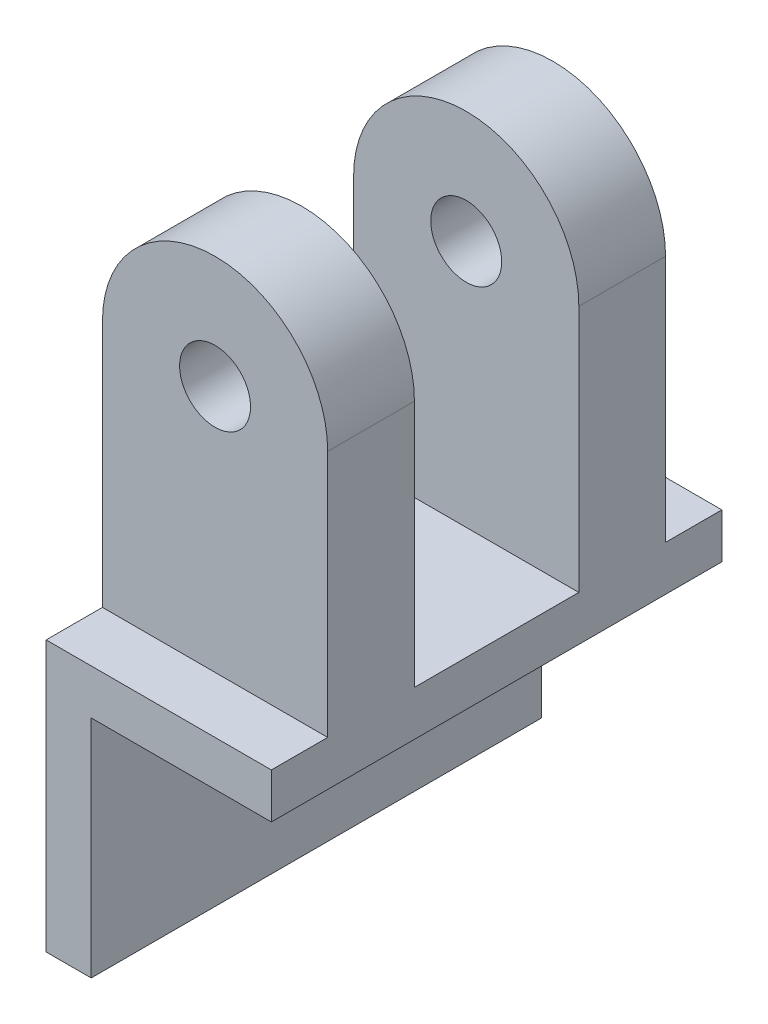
from build123d import *

# Parameters (mm, degrees)
SKETCH1_R           = 4.0005
BOSS_EXTRUDE1_DEPTH = 19.05
SKETCH1_2_R         = 4.0005
CUT_EXTRUDE1_DEPTH  = 9.271
BOSS_EXTRUDE2_DEPTH = 25.4


with BuildPart() as part:
    # Sketch1 → Boss-Extrude1 (new, symmetric)
    with BuildSketch(Plane.XY):
        with BuildLine():
            Line((12.7, 0), (-12.7, 0))
            Line((-12.7, 0), (-12.7, 33.02))
            ThreePointArc((-12.7, 33.02), (0, 45.72), (12.7, 33.02))
            Line((12.7, 33.02), (12.7, 0))
        make_face()
        with Locations(Location((0, 33.02, 0), (0, 0, 180))):
            Circle(SKETCH1_R, mode=Mode.SUBTRACT)
    extrude(amount=BOSS_EXTRUDE1_DEPTH, both=True)

    # Sketch1_2 → Cut-Extrude1 (cut, symmetric)
    with BuildSketch(Plane.XY):
        with BuildLine():
            Line((12.7, 0), (-12.7, 0))
            Line((-12.7, 0), (-12.7, 33.02))
            ThreePointArc((-12.7, 33.02), (0, 45.72), (12.7, 33.02))
            Line((12.7, 33.02), (12.7, 0))
        make_face()
        with Locations(Location((0, 33.02, 0), (0, 0, 180))):
            Circle(SKETCH1_2_R, mode=Mode.SUBTRACT)
    extrude(amount=CUT_EXTRUDE1_DEPTH, both=True, mode=Mode.SUBTRACT)


with BuildPart() as cut_extrude1_piece_1:
    # of the separate pieces the step leaves, piece 1, a body of its own (cut_extrude1_pieces)
    add(part.part.solids().sort_by_distance((12.7, 33.02, 9.271))[0])



with BuildPart() as cut_extrude1_piece_2:
    # of the separate pieces the step leaves, piece 2, a body of its own (cut_extrude1_pieces)
    add(part.part.solids().sort_by_distance((12.7, 33.02, -19.05))[0])


with BuildPart() as cut_extrude1_piece_1_1:
    add(cut_extrude1_piece_1.part)

    add(cut_extrude1_piece_2.part)  # Boss-Extrude2 merges Cut-Extrude1 piece 2
    # Sketch2 → Boss-Extrude2 (add, symmetric)
    with BuildSketch(Plane.XY):
        Polygon((12.7, 5.08), (-12.7, 5.08), (-12.7, -25.4), (-7.62, -25.4), (-7.62, 0), (12.7, 0), align=None)
    extrude(amount=BOSS_EXTRUDE2_DEPTH, both=True)


solid = cut_extrude1_piece_1_1.part
